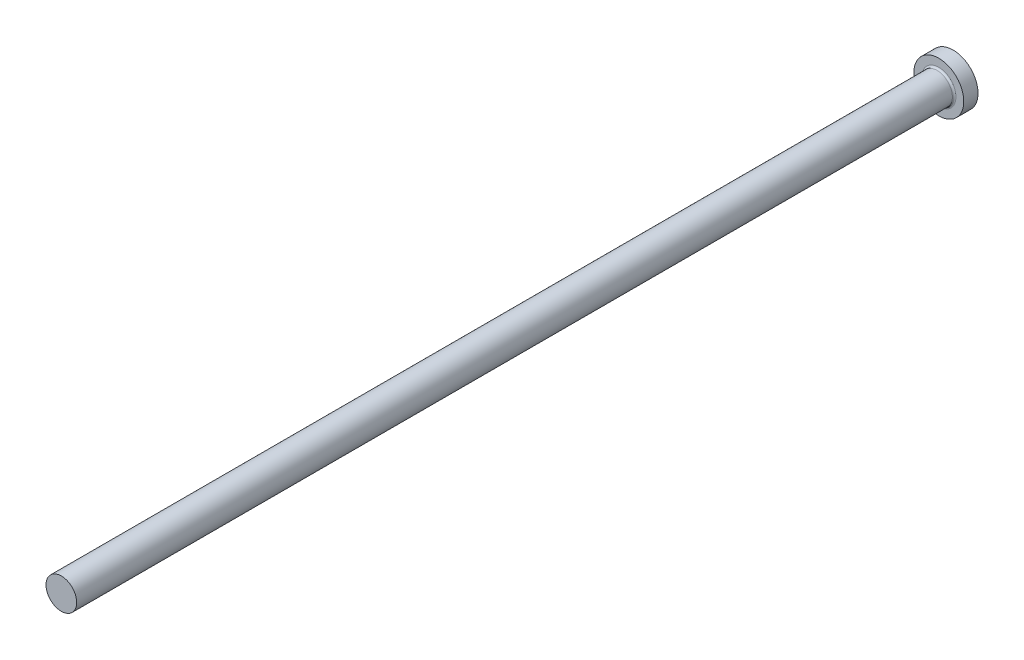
ISO-10303-21;
HEADER;
FILE_DESCRIPTION(('STEP AP214'),'2;1');
FILE_NAME('part.step','',(''),(''),'','','');
FILE_SCHEMA(('AUTOMOTIVE_DESIGN { 1 0 10303 214 1 1 1 1 }'));
ENDSEC;
DATA;
#1=APPLICATION_CONTEXT('core data for automotive mechanical design processes');
#2=APPLICATION_PROTOCOL_DEFINITION('international standard','automotive_design',2000,#1);
#3=PRODUCT_CONTEXT('',#1,'mechanical');
#4=PRODUCT('Part','Part','',(#3));
#5=PRODUCT_RELATED_PRODUCT_CATEGORY('part','',(#4));
#6=PRODUCT_DEFINITION_FORMATION('','',#4);
#7=PRODUCT_DEFINITION_CONTEXT('part definition',#1,'design');
#8=PRODUCT_DEFINITION('design','',#6,#7);
#9=PRODUCT_DEFINITION_SHAPE('','',#8);
#10=(LENGTH_UNIT() NAMED_UNIT(*) SI_UNIT(.MILLI.,.METRE.));
#11=(NAMED_UNIT(*) PLANE_ANGLE_UNIT() SI_UNIT($,.RADIAN.));
#12=(NAMED_UNIT(*) SI_UNIT($,.STERADIAN.) SOLID_ANGLE_UNIT());
#13=UNCERTAINTY_MEASURE_WITH_UNIT(LENGTH_MEASURE(1.E-05),#10,'distance_accuracy_value','');
#14=(GEOMETRIC_REPRESENTATION_CONTEXT(3) GLOBAL_UNCERTAINTY_ASSIGNED_CONTEXT((#13)) GLOBAL_UNIT_ASSIGNED_CONTEXT((#10,
#11,#12)) REPRESENTATION_CONTEXT('',''));
#15=CARTESIAN_POINT('',(0.,0.,0.));
#16=DIRECTION('',(0.,0.,1.));
#17=DIRECTION('',(1.,0.,0.));
#18=AXIS2_PLACEMENT_3D('',#15,#16,#17);
#19=CARTESIAN_POINT('',(7.,0.,4.));
#20=DIRECTION('',(0.,0.,-1.));
#21=DIRECTION('',(-1.,0.,0.));
#22=AXIS2_PLACEMENT_3D('',#19,#20,#21);
#23=PLANE('',#22);
#24=CARTESIAN_POINT('',(0.,0.,4.));
#25=DIRECTION('',(0.,0.,-1.));
#26=DIRECTION('',(-1.,0.,0.));
#27=AXIS2_PLACEMENT_3D('',#24,#25,#26);
#28=CIRCLE('',#27,4.80000000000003);
#29=CARTESIAN_POINT('',(-4.80000000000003,0.,4.));
#30=VERTEX_POINT('',#29);
#31=EDGE_CURVE('E40',#30,#30,#28,.T.);
#32=ORIENTED_EDGE('',*,*,#31,.T.);
#33=EDGE_LOOP('',(#32));
#34=FACE_BOUND('',#33,.T.);
#35=CARTESIAN_POINT('',(0.,0.,4.));
#36=DIRECTION('',(0.,0.,-1.));
#37=DIRECTION('',(-1.,0.,0.));
#38=AXIS2_PLACEMENT_3D('',#35,#36,#37);
#39=CIRCLE('',#38,7.);
#40=CARTESIAN_POINT('',(-7.,0.,4.));
#41=VERTEX_POINT('',#40);
#42=EDGE_CURVE('E44',#41,#41,#39,.T.);
#43=ORIENTED_EDGE('',*,*,#42,.F.);
#44=EDGE_LOOP('',(#43));
#45=FACE_BOUND('',#44,.T.);
#46=ADVANCED_FACE('F33',(#34,#45),#23,.F.);
#47=CARTESIAN_POINT('',(0.,0.,-9.03322817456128));
#48=DIRECTION('',(0.,0.,-1.));
#49=DIRECTION('',(-1.,0.,0.));
#50=AXIS2_PLACEMENT_3D('',#47,#48,#49);
#51=CYLINDRICAL_SURFACE('',#50,7.);
#52=CARTESIAN_POINT('',(0.,0.,0.));
#53=DIRECTION('',(0.,0.,-1.));
#54=DIRECTION('',(-1.,0.,0.));
#55=AXIS2_PLACEMENT_3D('',#52,#53,#54);
#56=CIRCLE('',#55,7.);
#57=CARTESIAN_POINT('',(-7.,0.,0.));
#58=VERTEX_POINT('',#57);
#59=EDGE_CURVE('E48',#58,#58,#56,.T.);
#60=ORIENTED_EDGE('',*,*,#59,.F.);
#61=EDGE_LOOP('',(#60));
#62=FACE_BOUND('',#61,.T.);
#63=ORIENTED_EDGE('',*,*,#42,.T.);
#64=EDGE_LOOP('',(#63));
#65=FACE_BOUND('',#64,.T.);
#66=ADVANCED_FACE('F68',(#62,#65),#51,.T.);
#67=CARTESIAN_POINT('',(0.,0.,0.));
#68=DIRECTION('',(0.,0.,1.));
#69=DIRECTION('',(1.,0.,0.));
#70=AXIS2_PLACEMENT_3D('',#67,#68,#69);
#71=PLANE('',#70);
#72=ORIENTED_EDGE('',*,*,#59,.T.);
#73=EDGE_LOOP('',(#72));
#74=FACE_BOUND('',#73,.T.);
#75=ADVANCED_FACE('F61',(#74),#71,.F.);
#76=CARTESIAN_POINT('',(0.,0.,250.));
#77=DIRECTION('',(0.,0.,-1.));
#78=DIRECTION('',(-1.,0.,0.));
#79=AXIS2_PLACEMENT_3D('',#76,#77,#78);
#80=PLANE('',#79);
#81=CARTESIAN_POINT('',(0.,0.,250.));
#82=DIRECTION('',(0.,0.,-1.));
#83=DIRECTION('',(-1.,0.,0.));
#84=AXIS2_PLACEMENT_3D('',#81,#82,#83);
#85=CIRCLE('',#84,4.30000000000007);
#86=CARTESIAN_POINT('',(-4.30000000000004,0.,250.));
#87=VERTEX_POINT('',#86);
#88=EDGE_CURVE('E53',#87,#87,#85,.T.);
#89=ORIENTED_EDGE('',*,*,#88,.F.);
#90=EDGE_LOOP('',(#89));
#91=FACE_BOUND('',#90,.T.);
#92=ADVANCED_FACE('F59',(#91),#80,.F.);
#93=CARTESIAN_POINT('',(0.,0.,-9.03322817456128));
#94=DIRECTION('',(0.,0.,-1.));
#95=DIRECTION('',(-1.,0.,0.));
#96=AXIS2_PLACEMENT_3D('',#93,#94,#95);
#97=CYLINDRICAL_SURFACE('',#96,4.30000000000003);
#98=CARTESIAN_POINT('',(0.,0.,4.5));
#99=DIRECTION('',(0.,0.,-1.));
#100=DIRECTION('',(-1.,0.,0.));
#101=AXIS2_PLACEMENT_3D('',#98,#99,#100);
#102=CIRCLE('',#101,4.30000000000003);
#103=CARTESIAN_POINT('',(-4.30000000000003,0.,4.5));
#104=VERTEX_POINT('',#103);
#105=EDGE_CURVE('E10',#104,#104,#102,.F.);
#106=ORIENTED_EDGE('',*,*,#105,.T.);
#107=EDGE_LOOP('',(#106));
#108=FACE_BOUND('',#107,.T.);
#109=ORIENTED_EDGE('',*,*,#88,.T.);
#110=EDGE_LOOP('',(#109));
#111=FACE_BOUND('',#110,.T.);
#112=ADVANCED_FACE('F57',(#108,#111),#97,.T.);
#113=CARTESIAN_POINT('',(0.,0.,4.5));
#114=DIRECTION('',(0.,0.,-1.));
#115=DIRECTION('',(-1.,0.,0.));
#116=AXIS2_PLACEMENT_3D('',#113,#114,#115);
#117=TOROIDAL_SURFACE('',#116,4.80000000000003,0.5);
#118=ORIENTED_EDGE('',*,*,#105,.F.);
#119=EDGE_LOOP('',(#118));
#120=FACE_BOUND('',#119,.T.);
#121=ORIENTED_EDGE('',*,*,#31,.F.);
#122=EDGE_LOOP('',(#121));
#123=FACE_BOUND('',#122,.T.);
#124=ADVANCED_FACE('F35',(#120,#123),#117,.F.);
#125=CLOSED_SHELL('',(#46,#66,#75,#92,#112,#124));
#126=MANIFOLD_SOLID_BREP('B2',#125);
#127=ADVANCED_BREP_SHAPE_REPRESENTATION('',(#18,#126),#14);
#128=SHAPE_DEFINITION_REPRESENTATION(#9,#127);
ENDSEC;
END-ISO-10303-21;
